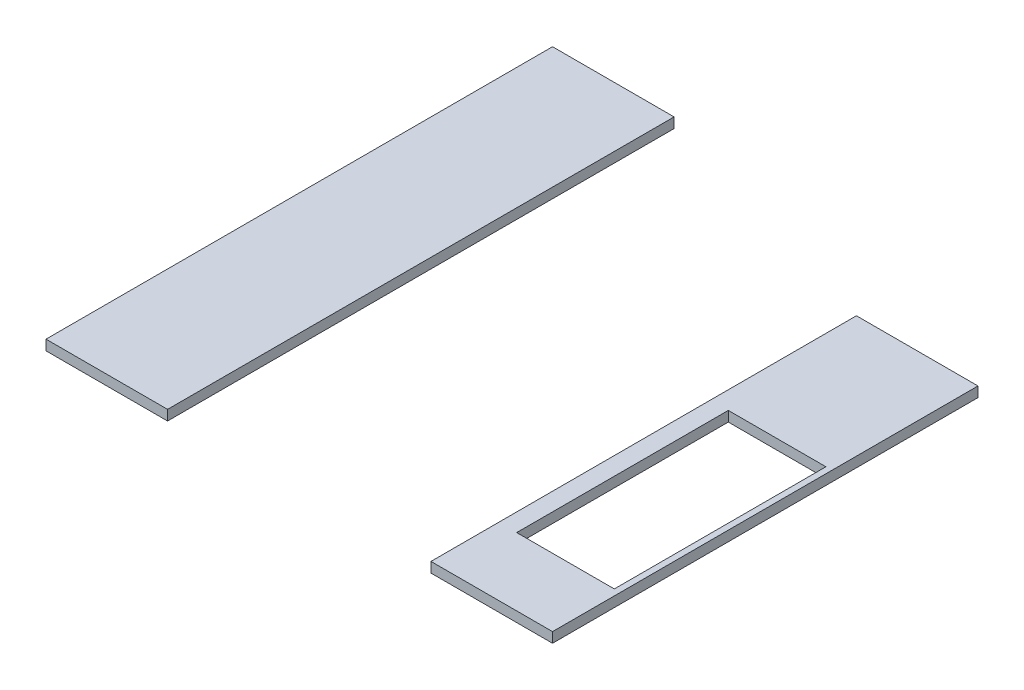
ISO-10303-21;
HEADER;
FILE_DESCRIPTION(('STEP AP214'),'2;1');
FILE_NAME('part.step','',(''),(''),'','','');
FILE_SCHEMA(('AUTOMOTIVE_DESIGN { 1 0 10303 214 1 1 1 1 }'));
ENDSEC;
DATA;
#1=APPLICATION_CONTEXT('core data for automotive mechanical design processes');
#2=APPLICATION_PROTOCOL_DEFINITION('international standard','automotive_design',2000,#1);
#3=PRODUCT_CONTEXT('',#1,'mechanical');
#4=PRODUCT('Part','Part','',(#3));
#5=PRODUCT_RELATED_PRODUCT_CATEGORY('part','',(#4));
#6=PRODUCT_DEFINITION_FORMATION('','',#4);
#7=PRODUCT_DEFINITION_CONTEXT('part definition',#1,'design');
#8=PRODUCT_DEFINITION('design','',#6,#7);
#9=PRODUCT_DEFINITION_SHAPE('','',#8);
#10=(LENGTH_UNIT() NAMED_UNIT(*) SI_UNIT(.MILLI.,.METRE.));
#11=(NAMED_UNIT(*) PLANE_ANGLE_UNIT() SI_UNIT($,.RADIAN.));
#12=(NAMED_UNIT(*) SI_UNIT($,.STERADIAN.) SOLID_ANGLE_UNIT());
#13=UNCERTAINTY_MEASURE_WITH_UNIT(LENGTH_MEASURE(1.E-05),#10,'distance_accuracy_value','');
#14=(GEOMETRIC_REPRESENTATION_CONTEXT(3) GLOBAL_UNCERTAINTY_ASSIGNED_CONTEXT((#13)) GLOBAL_UNIT_ASSIGNED_CONTEXT((#10,
#11,#12)) REPRESENTATION_CONTEXT('',''));
#15=CARTESIAN_POINT('',(0.,0.,0.));
#16=DIRECTION('',(0.,0.,1.));
#17=DIRECTION('',(1.,0.,0.));
#18=AXIS2_PLACEMENT_3D('',#15,#16,#17);
#19=CARTESIAN_POINT('',(-1900.,50.,0.));
#20=DIRECTION('',(-1.,0.,0.));
#21=DIRECTION('',(0.,0.,1.));
#22=AXIS2_PLACEMENT_3D('',#19,#20,#21);
#23=PLANE('',#22);
#24=DIRECTION('',(0.,0.,-1.));
#25=VECTOR('',#24,1.);
#26=CARTESIAN_POINT('',(-1900.,0.,0.));
#27=LINE('',#26,#25);
#28=CARTESIAN_POINT('',(-1900.,0.,0.));
#29=VERTEX_POINT('',#28);
#30=CARTESIAN_POINT('',(-1900.,0.,-2500.));
#31=VERTEX_POINT('',#30);
#32=EDGE_CURVE('E106',#29,#31,#27,.T.);
#33=ORIENTED_EDGE('',*,*,#32,.T.);
#34=DIRECTION('',(0.,-1.,0.));
#35=VECTOR('',#34,1.);
#36=CARTESIAN_POINT('',(-1900.,50.,-2500.));
#37=LINE('',#36,#35);
#38=CARTESIAN_POINT('',(-1900.,50.,-2500.));
#39=VERTEX_POINT('',#38);
#40=EDGE_CURVE('E12',#39,#31,#37,.T.);
#41=ORIENTED_EDGE('',*,*,#40,.F.);
#42=DIRECTION('',(0.,0.,-1.));
#43=VECTOR('',#42,1.);
#44=CARTESIAN_POINT('',(-1900.,50.,0.));
#45=LINE('',#44,#43);
#46=CARTESIAN_POINT('',(-1900.,50.,0.));
#47=VERTEX_POINT('',#46);
#48=EDGE_CURVE('E94',#47,#39,#45,.T.);
#49=ORIENTED_EDGE('',*,*,#48,.F.);
#50=DIRECTION('',(0.,-1.,0.));
#51=VECTOR('',#50,1.);
#52=CARTESIAN_POINT('',(-1900.,50.,0.));
#53=LINE('',#52,#51);
#54=EDGE_CURVE('E102',#47,#29,#53,.T.);
#55=ORIENTED_EDGE('',*,*,#54,.T.);
#56=EDGE_LOOP('',(#33,#41,#49,#55));
#57=FACE_BOUND('',#56,.T.);
#58=ADVANCED_FACE('F43',(#57),#23,.F.);
#59=CARTESIAN_POINT('',(-1900.,50.,-2500.));
#60=DIRECTION('',(0.,0.,1.));
#61=DIRECTION('',(1.,0.,0.));
#62=AXIS2_PLACEMENT_3D('',#59,#60,#61);
#63=PLANE('',#62);
#64=DIRECTION('',(-1.,0.,0.));
#65=VECTOR('',#64,1.);
#66=CARTESIAN_POINT('',(-1900.,0.,-2500.));
#67=LINE('',#66,#65);
#68=CARTESIAN_POINT('',(-2500.,0.,-2500.));
#69=VERTEX_POINT('',#68);
#70=EDGE_CURVE('E98',#31,#69,#67,.T.);
#71=ORIENTED_EDGE('',*,*,#70,.T.);
#72=DIRECTION('',(0.,-1.,0.));
#73=VECTOR('',#72,1.);
#74=CARTESIAN_POINT('',(-2500.,50.,-2500.));
#75=LINE('',#74,#73);
#76=CARTESIAN_POINT('',(-2500.,50.,-2500.));
#77=VERTEX_POINT('',#76);
#78=EDGE_CURVE('E51',#77,#69,#75,.T.);
#79=ORIENTED_EDGE('',*,*,#78,.F.);
#80=DIRECTION('',(-1.,0.,0.));
#81=VECTOR('',#80,1.);
#82=CARTESIAN_POINT('',(-1900.,50.,-2500.));
#83=LINE('',#82,#81);
#84=EDGE_CURVE('E89',#39,#77,#83,.T.);
#85=ORIENTED_EDGE('',*,*,#84,.F.);
#86=ORIENTED_EDGE('',*,*,#40,.T.);
#87=EDGE_LOOP('',(#71,#79,#85,#86));
#88=FACE_BOUND('',#87,.T.);
#89=ADVANCED_FACE('F97',(#88),#63,.F.);
#90=CARTESIAN_POINT('',(-2500.,50.,0.));
#91=DIRECTION('',(1.,0.,0.));
#92=DIRECTION('',(0.,0.,-1.));
#93=AXIS2_PLACEMENT_3D('',#90,#91,#92);
#94=PLANE('',#93);
#95=DIRECTION('',(0.,0.,1.));
#96=VECTOR('',#95,1.);
#97=CARTESIAN_POINT('',(-2500.,0.,0.));
#98=LINE('',#97,#96);
#99=CARTESIAN_POINT('',(-2500.,0.,0.));
#100=VERTEX_POINT('',#99);
#101=EDGE_CURVE('E76',#69,#100,#98,.T.);
#102=ORIENTED_EDGE('',*,*,#101,.T.);
#103=DIRECTION('',(0.,-1.,0.));
#104=VECTOR('',#103,1.);
#105=CARTESIAN_POINT('',(-2500.,50.,0.));
#106=LINE('',#105,#104);
#107=CARTESIAN_POINT('',(-2500.,50.,0.));
#108=VERTEX_POINT('',#107);
#109=EDGE_CURVE('E99',#108,#100,#106,.T.);
#110=ORIENTED_EDGE('',*,*,#109,.F.);
#111=DIRECTION('',(0.,0.,1.));
#112=VECTOR('',#111,1.);
#113=CARTESIAN_POINT('',(-2500.,50.,0.));
#114=LINE('',#113,#112);
#115=EDGE_CURVE('E92',#77,#108,#114,.T.);
#116=ORIENTED_EDGE('',*,*,#115,.F.);
#117=ORIENTED_EDGE('',*,*,#78,.T.);
#118=EDGE_LOOP('',(#102,#110,#116,#117));
#119=FACE_BOUND('',#118,.T.);
#120=ADVANCED_FACE('F100',(#119),#94,.F.);
#121=CARTESIAN_POINT('',(-1900.,50.,0.));
#122=DIRECTION('',(0.,0.,-1.));
#123=DIRECTION('',(-1.,0.,0.));
#124=AXIS2_PLACEMENT_3D('',#121,#122,#123);
#125=PLANE('',#124);
#126=DIRECTION('',(1.,0.,0.));
#127=VECTOR('',#126,1.);
#128=CARTESIAN_POINT('',(-1900.,0.,0.));
#129=LINE('',#128,#127);
#130=EDGE_CURVE('E82',#100,#29,#129,.T.);
#131=ORIENTED_EDGE('',*,*,#130,.T.);
#132=ORIENTED_EDGE('',*,*,#54,.F.);
#133=DIRECTION('',(1.,0.,0.));
#134=VECTOR('',#133,1.);
#135=CARTESIAN_POINT('',(-1900.,50.,0.));
#136=LINE('',#135,#134);
#137=EDGE_CURVE('E59',#108,#47,#136,.T.);
#138=ORIENTED_EDGE('',*,*,#137,.F.);
#139=ORIENTED_EDGE('',*,*,#109,.T.);
#140=EDGE_LOOP('',(#131,#132,#138,#139));
#141=FACE_BOUND('',#140,.T.);
#142=ADVANCED_FACE('F113',(#141),#125,.F.);
#143=CARTESIAN_POINT('',(0.,50.,0.));
#144=DIRECTION('',(0.,1.,0.));
#145=DIRECTION('',(0.,0.,1.));
#146=AXIS2_PLACEMENT_3D('',#143,#144,#145);
#147=PLANE('',#146);
#148=ORIENTED_EDGE('',*,*,#48,.T.);
#149=ORIENTED_EDGE('',*,*,#84,.T.);
#150=ORIENTED_EDGE('',*,*,#115,.T.);
#151=ORIENTED_EDGE('',*,*,#137,.T.);
#152=EDGE_LOOP('',(#148,#149,#150,#151));
#153=FACE_BOUND('',#152,.T.);
#154=ADVANCED_FACE('F90',(#153),#147,.T.);
#155=CARTESIAN_POINT('',(0.,0.,0.));
#156=DIRECTION('',(0.,1.,0.));
#157=DIRECTION('',(0.,0.,1.));
#158=AXIS2_PLACEMENT_3D('',#155,#156,#157);
#159=PLANE('',#158);
#160=ORIENTED_EDGE('',*,*,#32,.F.);
#161=ORIENTED_EDGE('',*,*,#130,.F.);
#162=ORIENTED_EDGE('',*,*,#101,.F.);
#163=ORIENTED_EDGE('',*,*,#70,.F.);
#164=EDGE_LOOP('',(#160,#161,#162,#163));
#165=FACE_BOUND('',#164,.T.);
#166=ADVANCED_FACE('F116',(#165),#159,.F.);
#167=CLOSED_SHELL('',(#58,#89,#120,#142,#154,#166));
#168=MANIFOLD_SOLID_BREP('B2',#167);
#169=CARTESIAN_POINT('',(0.,50.,0.));
#170=DIRECTION('',(-1.,0.,0.));
#171=DIRECTION('',(0.,0.,1.));
#172=AXIS2_PLACEMENT_3D('',#169,#170,#171);
#173=PLANE('',#172);
#174=DIRECTION('',(0.,0.,-1.));
#175=VECTOR('',#174,1.);
#176=CARTESIAN_POINT('',(0.,0.,0.));
#177=LINE('',#176,#175);
#178=CARTESIAN_POINT('',(0.,0.,0.));
#179=VERTEX_POINT('',#178);
#180=CARTESIAN_POINT('',(0.,0.,-2100.));
#181=VERTEX_POINT('',#180);
#182=EDGE_CURVE('E257',#179,#181,#177,.T.);
#183=ORIENTED_EDGE('',*,*,#182,.T.);
#184=DIRECTION('',(0.,-1.,0.));
#185=VECTOR('',#184,1.);
#186=CARTESIAN_POINT('',(0.,50.,-2100.));
#187=LINE('',#186,#185);
#188=CARTESIAN_POINT('',(0.,50.,-2100.));
#189=VERTEX_POINT('',#188);
#190=EDGE_CURVE('E286',#189,#181,#187,.T.);
#191=ORIENTED_EDGE('',*,*,#190,.F.);
#192=DIRECTION('',(0.,0.,-1.));
#193=VECTOR('',#192,1.);
#194=CARTESIAN_POINT('',(0.,50.,0.));
#195=LINE('',#194,#193);
#196=CARTESIAN_POINT('',(0.,50.,0.));
#197=VERTEX_POINT('',#196);
#198=EDGE_CURVE('E260',#197,#189,#195,.T.);
#199=ORIENTED_EDGE('',*,*,#198,.F.);
#200=DIRECTION('',(0.,-1.,0.));
#201=VECTOR('',#200,1.);
#202=CARTESIAN_POINT('',(0.,50.,0.));
#203=LINE('',#202,#201);
#204=EDGE_CURVE('E270',#197,#179,#203,.T.);
#205=ORIENTED_EDGE('',*,*,#204,.T.);
#206=EDGE_LOOP('',(#183,#191,#199,#205));
#207=FACE_BOUND('',#206,.T.);
#208=ADVANCED_FACE('F167',(#207),#173,.F.);
#209=CARTESIAN_POINT('',(0.,50.,-2100.));
#210=DIRECTION('',(0.,0.,1.));
#211=DIRECTION('',(1.,0.,0.));
#212=AXIS2_PLACEMENT_3D('',#209,#210,#211);
#213=PLANE('',#212);
#214=DIRECTION('',(-1.,0.,0.));
#215=VECTOR('',#214,1.);
#216=CARTESIAN_POINT('',(0.,0.,-2100.));
#217=LINE('',#216,#215);
#218=CARTESIAN_POINT('',(-600.,0.,-2100.));
#219=VERTEX_POINT('',#218);
#220=EDGE_CURVE('E273',#181,#219,#217,.T.);
#221=ORIENTED_EDGE('',*,*,#220,.T.);
#222=DIRECTION('',(0.,-1.,0.));
#223=VECTOR('',#222,1.);
#224=CARTESIAN_POINT('',(-600.,50.,-2100.));
#225=LINE('',#224,#223);
#226=CARTESIAN_POINT('',(-600.,50.,-2100.));
#227=VERTEX_POINT('',#226);
#228=EDGE_CURVE('E283',#227,#219,#225,.T.);
#229=ORIENTED_EDGE('',*,*,#228,.F.);
#230=DIRECTION('',(-1.,0.,0.));
#231=VECTOR('',#230,1.);
#232=CARTESIAN_POINT('',(0.,50.,-2100.));
#233=LINE('',#232,#231);
#234=EDGE_CURVE('E263',#189,#227,#233,.T.);
#235=ORIENTED_EDGE('',*,*,#234,.F.);
#236=ORIENTED_EDGE('',*,*,#190,.T.);
#237=EDGE_LOOP('',(#221,#229,#235,#236));
#238=FACE_BOUND('',#237,.T.);
#239=ADVANCED_FACE('F310',(#238),#213,.F.);
#240=CARTESIAN_POINT('',(-600.,50.,0.));
#241=DIRECTION('',(1.,0.,0.));
#242=DIRECTION('',(0.,0.,-1.));
#243=AXIS2_PLACEMENT_3D('',#240,#241,#242);
#244=PLANE('',#243);
#245=DIRECTION('',(0.,0.,1.));
#246=VECTOR('',#245,1.);
#247=CARTESIAN_POINT('',(-600.,0.,0.));
#248=LINE('',#247,#246);
#249=CARTESIAN_POINT('',(-600.,0.,0.));
#250=VERTEX_POINT('',#249);
#251=EDGE_CURVE('E275',#219,#250,#248,.T.);
#252=ORIENTED_EDGE('',*,*,#251,.T.);
#253=DIRECTION('',(0.,-1.,0.));
#254=VECTOR('',#253,1.);
#255=CARTESIAN_POINT('',(-600.,50.,0.));
#256=LINE('',#255,#254);
#257=CARTESIAN_POINT('',(-600.,50.,0.));
#258=VERTEX_POINT('',#257);
#259=EDGE_CURVE('E280',#258,#250,#256,.T.);
#260=ORIENTED_EDGE('',*,*,#259,.F.);
#261=DIRECTION('',(0.,0.,1.));
#262=VECTOR('',#261,1.);
#263=CARTESIAN_POINT('',(-600.,50.,0.));
#264=LINE('',#263,#262);
#265=EDGE_CURVE('E266',#227,#258,#264,.T.);
#266=ORIENTED_EDGE('',*,*,#265,.F.);
#267=ORIENTED_EDGE('',*,*,#228,.T.);
#268=EDGE_LOOP('',(#252,#260,#266,#267));
#269=FACE_BOUND('',#268,.T.);
#270=ADVANCED_FACE('F315',(#269),#244,.F.);
#271=CARTESIAN_POINT('',(0.,50.,0.));
#272=DIRECTION('',(0.,0.,-1.));
#273=DIRECTION('',(-1.,0.,0.));
#274=AXIS2_PLACEMENT_3D('',#271,#272,#273);
#275=PLANE('',#274);
#276=DIRECTION('',(1.,0.,0.));
#277=VECTOR('',#276,1.);
#278=CARTESIAN_POINT('',(0.,0.,0.));
#279=LINE('',#278,#277);
#280=EDGE_CURVE('E264',#250,#179,#279,.T.);
#281=ORIENTED_EDGE('',*,*,#280,.T.);
#282=ORIENTED_EDGE('',*,*,#204,.F.);
#283=DIRECTION('',(1.,0.,0.));
#284=VECTOR('',#283,1.);
#285=CARTESIAN_POINT('',(0.,50.,0.));
#286=LINE('',#285,#284);
#287=EDGE_CURVE('E268',#258,#197,#286,.T.);
#288=ORIENTED_EDGE('',*,*,#287,.F.);
#289=ORIENTED_EDGE('',*,*,#259,.T.);
#290=EDGE_LOOP('',(#281,#282,#288,#289));
#291=FACE_BOUND('',#290,.T.);
#292=ADVANCED_FACE('F328',(#291),#275,.F.);
#293=CARTESIAN_POINT('',(0.,50.,0.));
#294=DIRECTION('',(0.,1.,0.));
#295=DIRECTION('',(0.,0.,1.));
#296=AXIS2_PLACEMENT_3D('',#293,#294,#295);
#297=PLANE('',#296);
#298=DIRECTION('',(0.,0.,1.));
#299=VECTOR('',#298,1.);
#300=CARTESIAN_POINT('',(-511.668224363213,50.,-1379.27424722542));
#301=LINE('',#300,#299);
#302=CARTESIAN_POINT('',(-511.668224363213,50.,-1379.27424722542));
#303=VERTEX_POINT('',#302);
#304=CARTESIAN_POINT('',(-511.668224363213,50.,-334.827382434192));
#305=VERTEX_POINT('',#304);
#306=EDGE_CURVE('E181',#303,#305,#301,.T.);
#307=ORIENTED_EDGE('',*,*,#306,.F.);
#308=DIRECTION('',(-1.,0.,0.));
#309=VECTOR('',#308,1.);
#310=CARTESIAN_POINT('',(-511.668224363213,50.,-1379.27424722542));
#311=LINE('',#310,#309);
#312=CARTESIAN_POINT('',(-29.8781243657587,50.,-1379.27424722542));
#313=VERTEX_POINT('',#312);
#314=EDGE_CURVE('E250',#313,#303,#311,.T.);
#315=ORIENTED_EDGE('',*,*,#314,.F.);
#316=DIRECTION('',(0.,0.,-1.));
#317=VECTOR('',#316,1.);
#318=CARTESIAN_POINT('',(-29.8781243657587,50.,-1379.27424722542));
#319=LINE('',#318,#317);
#320=CARTESIAN_POINT('',(-29.8781243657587,50.,-334.827382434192));
#321=VERTEX_POINT('',#320);
#322=EDGE_CURVE('E234',#321,#313,#319,.T.);
#323=ORIENTED_EDGE('',*,*,#322,.F.);
#324=DIRECTION('',(1.,0.,0.));
#325=VECTOR('',#324,1.);
#326=CARTESIAN_POINT('',(-511.668224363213,50.,-334.827382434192));
#327=LINE('',#326,#325);
#328=EDGE_CURVE('E243',#305,#321,#327,.T.);
#329=ORIENTED_EDGE('',*,*,#328,.F.);
#330=EDGE_LOOP('',(#307,#315,#323,#329));
#331=FACE_BOUND('',#330,.T.);
#332=ORIENTED_EDGE('',*,*,#198,.T.);
#333=ORIENTED_EDGE('',*,*,#234,.T.);
#334=ORIENTED_EDGE('',*,*,#265,.T.);
#335=ORIENTED_EDGE('',*,*,#287,.T.);
#336=EDGE_LOOP('',(#332,#333,#334,#335));
#337=FACE_BOUND('',#336,.T.);
#338=ADVANCED_FACE('F247',(#331,#337),#297,.T.);
#339=CARTESIAN_POINT('',(0.,0.,0.));
#340=DIRECTION('',(0.,1.,0.));
#341=DIRECTION('',(0.,0.,1.));
#342=AXIS2_PLACEMENT_3D('',#339,#340,#341);
#343=PLANE('',#342);
#344=DIRECTION('',(-1.,0.,0.));
#345=VECTOR('',#344,1.);
#346=CARTESIAN_POINT('',(0.,0.,-1379.27424722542));
#347=LINE('',#346,#345);
#348=CARTESIAN_POINT('',(-29.8781243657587,0.,-1379.27424722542));
#349=VERTEX_POINT('',#348);
#350=CARTESIAN_POINT('',(-511.668224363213,0.,-1379.27424722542));
#351=VERTEX_POINT('',#350);
#352=EDGE_CURVE('E174',#349,#351,#347,.T.);
#353=ORIENTED_EDGE('',*,*,#352,.T.);
#354=DIRECTION('',(0.,0.,1.));
#355=VECTOR('',#354,1.);
#356=CARTESIAN_POINT('',(-511.668224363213,0.,0.));
#357=LINE('',#356,#355);
#358=CARTESIAN_POINT('',(-511.668224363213,0.,-334.827382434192));
#359=VERTEX_POINT('',#358);
#360=EDGE_CURVE('E41',#351,#359,#357,.T.);
#361=ORIENTED_EDGE('',*,*,#360,.T.);
#362=DIRECTION('',(1.,0.,0.));
#363=VECTOR('',#362,1.);
#364=CARTESIAN_POINT('',(0.,0.,-334.827382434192));
#365=LINE('',#364,#363);
#366=CARTESIAN_POINT('',(-29.8781243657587,0.,-334.827382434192));
#367=VERTEX_POINT('',#366);
#368=EDGE_CURVE('E289',#359,#367,#365,.T.);
#369=ORIENTED_EDGE('',*,*,#368,.T.);
#370=DIRECTION('',(0.,0.,-1.));
#371=VECTOR('',#370,1.);
#372=CARTESIAN_POINT('',(-29.8781243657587,0.,0.));
#373=LINE('',#372,#371);
#374=EDGE_CURVE('E237',#367,#349,#373,.T.);
#375=ORIENTED_EDGE('',*,*,#374,.T.);
#376=EDGE_LOOP('',(#353,#361,#369,#375));
#377=FACE_BOUND('',#376,.T.);
#378=ORIENTED_EDGE('',*,*,#182,.F.);
#379=ORIENTED_EDGE('',*,*,#280,.F.);
#380=ORIENTED_EDGE('',*,*,#251,.F.);
#381=ORIENTED_EDGE('',*,*,#220,.F.);
#382=EDGE_LOOP('',(#378,#379,#380,#381));
#383=FACE_BOUND('',#382,.T.);
#384=ADVANCED_FACE('F293',(#377,#383),#343,.F.);
#385=CARTESIAN_POINT('',(-511.668224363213,-9.99999999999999,-1379.27424722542));
#386=DIRECTION('',(-1.,0.,0.));
#387=DIRECTION('',(0.,0.,1.));
#388=AXIS2_PLACEMENT_3D('',#385,#386,#387);
#389=PLANE('',#388);
#390=DIRECTION('',(0.,1.,0.));
#391=VECTOR('',#390,1.);
#392=CARTESIAN_POINT('',(-511.668224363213,-9.99999999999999,-1379.27424722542));
#393=LINE('',#392,#391);
#394=EDGE_CURVE('E255',#351,#303,#393,.T.);
#395=ORIENTED_EDGE('',*,*,#394,.T.);
#396=ORIENTED_EDGE('',*,*,#306,.T.);
#397=DIRECTION('',(0.,1.,0.));
#398=VECTOR('',#397,1.);
#399=CARTESIAN_POINT('',(-511.668224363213,-9.99999999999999,-334.827382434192));
#400=LINE('',#399,#398);
#401=EDGE_CURVE('E240',#359,#305,#400,.T.);
#402=ORIENTED_EDGE('',*,*,#401,.F.);
#403=ORIENTED_EDGE('',*,*,#360,.F.);
#404=EDGE_LOOP('',(#395,#396,#402,#403));
#405=FACE_BOUND('',#404,.T.);
#406=ADVANCED_FACE('F298',(#405),#389,.F.);
#407=CARTESIAN_POINT('',(-511.668224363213,-9.99999999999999,-1379.27424722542));
#408=DIRECTION('',(0.,0.,-1.));
#409=DIRECTION('',(-1.,0.,0.));
#410=AXIS2_PLACEMENT_3D('',#407,#408,#409);
#411=PLANE('',#410);
#412=DIRECTION('',(0.,1.,0.));
#413=VECTOR('',#412,1.);
#414=CARTESIAN_POINT('',(-29.8781243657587,-9.99999999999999,-1379.27424722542));
#415=LINE('',#414,#413);
#416=EDGE_CURVE('E239',#349,#313,#415,.T.);
#417=ORIENTED_EDGE('',*,*,#416,.T.);
#418=ORIENTED_EDGE('',*,*,#314,.T.);
#419=ORIENTED_EDGE('',*,*,#394,.F.);
#420=ORIENTED_EDGE('',*,*,#352,.F.);
#421=EDGE_LOOP('',(#417,#418,#419,#420));
#422=FACE_BOUND('',#421,.T.);
#423=ADVANCED_FACE('F297',(#422),#411,.F.);
#424=CARTESIAN_POINT('',(-29.8781243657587,-9.99999999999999,-1379.27424722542));
#425=DIRECTION('',(1.,0.,0.));
#426=DIRECTION('',(0.,0.,-1.));
#427=AXIS2_PLACEMENT_3D('',#424,#425,#426);
#428=PLANE('',#427);
#429=DIRECTION('',(0.,1.,0.));
#430=VECTOR('',#429,1.);
#431=CARTESIAN_POINT('',(-29.8781243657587,-9.99999999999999,-334.827382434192));
#432=LINE('',#431,#430);
#433=EDGE_CURVE('E189',#367,#321,#432,.T.);
#434=ORIENTED_EDGE('',*,*,#433,.T.);
#435=ORIENTED_EDGE('',*,*,#322,.T.);
#436=ORIENTED_EDGE('',*,*,#416,.F.);
#437=ORIENTED_EDGE('',*,*,#374,.F.);
#438=EDGE_LOOP('',(#434,#435,#436,#437));
#439=FACE_BOUND('',#438,.T.);
#440=ADVANCED_FACE('F231',(#439),#428,.F.);
#441=CARTESIAN_POINT('',(-511.668224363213,-9.99999999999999,-334.827382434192));
#442=DIRECTION('',(0.,0.,1.));
#443=DIRECTION('',(1.,0.,0.));
#444=AXIS2_PLACEMENT_3D('',#441,#442,#443);
#445=PLANE('',#444);
#446=ORIENTED_EDGE('',*,*,#401,.T.);
#447=ORIENTED_EDGE('',*,*,#328,.T.);
#448=ORIENTED_EDGE('',*,*,#433,.F.);
#449=ORIENTED_EDGE('',*,*,#368,.F.);
#450=EDGE_LOOP('',(#446,#447,#448,#449));
#451=FACE_BOUND('',#450,.T.);
#452=ADVANCED_FACE('F244',(#451),#445,.F.);
#453=CLOSED_SHELL('',(#208,#239,#270,#292,#338,#384,#406,#423,#440,#452));
#454=MANIFOLD_SOLID_BREP('B6',#453);
#455=ADVANCED_BREP_SHAPE_REPRESENTATION('',(#18,#168,#454),#14);
#456=SHAPE_DEFINITION_REPRESENTATION(#9,#455);
ENDSEC;
END-ISO-10303-21;
